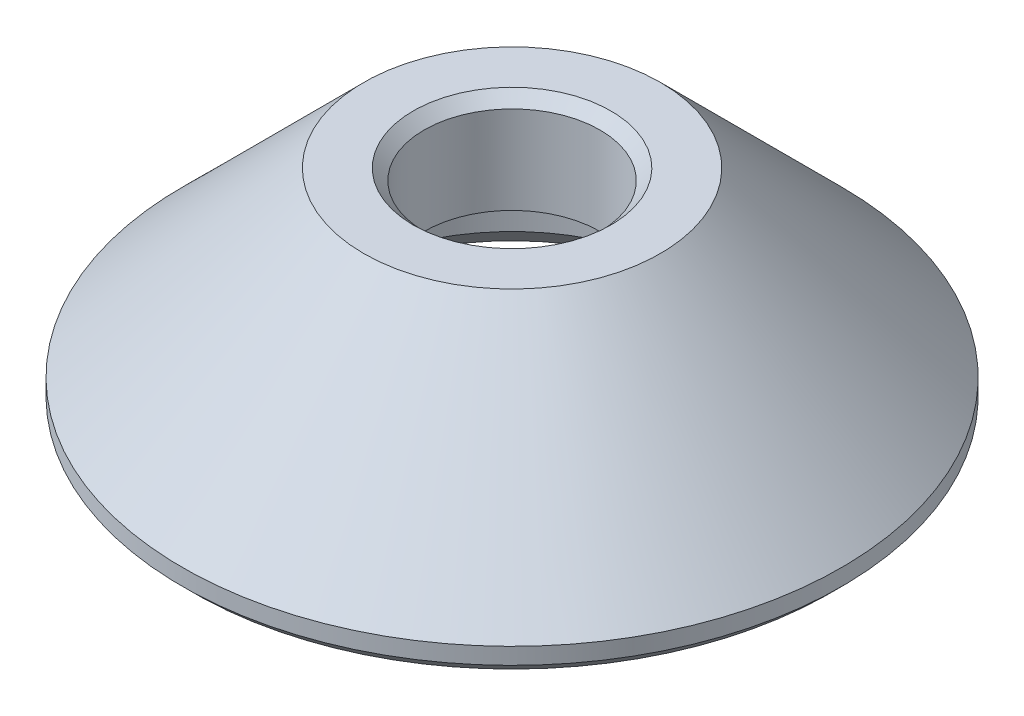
ISO-10303-21;
HEADER;
FILE_DESCRIPTION(('STEP AP214'),'2;1');
FILE_NAME('part.step','',(''),(''),'','','');
FILE_SCHEMA(('AUTOMOTIVE_DESIGN { 1 0 10303 214 1 1 1 1 }'));
ENDSEC;
DATA;
#1=APPLICATION_CONTEXT('core data for automotive mechanical design processes');
#2=APPLICATION_PROTOCOL_DEFINITION('international standard','automotive_design',2000,#1);
#3=PRODUCT_CONTEXT('',#1,'mechanical');
#4=PRODUCT('Part','Part','',(#3));
#5=PRODUCT_RELATED_PRODUCT_CATEGORY('part','',(#4));
#6=PRODUCT_DEFINITION_FORMATION('','',#4);
#7=PRODUCT_DEFINITION_CONTEXT('part definition',#1,'design');
#8=PRODUCT_DEFINITION('design','',#6,#7);
#9=PRODUCT_DEFINITION_SHAPE('','',#8);
#10=(LENGTH_UNIT() NAMED_UNIT(*) SI_UNIT(.MILLI.,.METRE.));
#11=(NAMED_UNIT(*) PLANE_ANGLE_UNIT() SI_UNIT($,.RADIAN.));
#12=(NAMED_UNIT(*) SI_UNIT($,.STERADIAN.) SOLID_ANGLE_UNIT());
#13=UNCERTAINTY_MEASURE_WITH_UNIT(LENGTH_MEASURE(1.E-05),#10,'distance_accuracy_value','');
#14=(GEOMETRIC_REPRESENTATION_CONTEXT(3) GLOBAL_UNCERTAINTY_ASSIGNED_CONTEXT((#13)) GLOBAL_UNIT_ASSIGNED_CONTEXT((#10,
#11,#12)) REPRESENTATION_CONTEXT('',''));
#15=CARTESIAN_POINT('',(0.,0.,0.));
#16=DIRECTION('',(0.,0.,1.));
#17=DIRECTION('',(1.,0.,0.));
#18=AXIS2_PLACEMENT_3D('',#15,#16,#17);
#19=CARTESIAN_POINT('',(0.,0.,0.));
#20=DIRECTION('',(0.,-1.,0.));
#21=DIRECTION('',(0.,0.,-1.));
#22=AXIS2_PLACEMENT_3D('',#19,#20,#21);
#23=CYLINDRICAL_SURFACE('',#22,3.25);
#24=CARTESIAN_POINT('',(0.,0.254773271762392,0.));
#25=DIRECTION('',(0.,-1.,0.));
#26=DIRECTION('',(0.,0.,-1.));
#27=AXIS2_PLACEMENT_3D('',#24,#25,#26);
#28=CIRCLE('',#27,3.25);
#29=CARTESIAN_POINT('',(0.,0.254773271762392,-3.25));
#30=VERTEX_POINT('',#29);
#31=EDGE_CURVE('E52',#30,#30,#28,.T.);
#32=ORIENTED_EDGE('',*,*,#31,.T.);
#33=EDGE_LOOP('',(#32));
#34=FACE_BOUND('',#33,.T.);
#35=CARTESIAN_POINT('',(0.,1.75477327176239,0.));
#36=DIRECTION('',(0.,-1.,0.));
#37=DIRECTION('',(0.,0.,-1.));
#38=AXIS2_PLACEMENT_3D('',#35,#36,#37);
#39=CIRCLE('',#38,3.25);
#40=CARTESIAN_POINT('',(0.,1.75477327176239,-3.25));
#41=VERTEX_POINT('',#40);
#42=EDGE_CURVE('E64',#41,#41,#39,.T.);
#43=ORIENTED_EDGE('',*,*,#42,.F.);
#44=EDGE_LOOP('',(#43));
#45=FACE_BOUND('',#44,.T.);
#46=ADVANCED_FACE('F29',(#34,#45),#23,.F.);
#47=CARTESIAN_POINT('',(3.25,-0.245226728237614,0.));
#48=DIRECTION('',(0.,-1.,0.));
#49=DIRECTION('',(0.,0.,-1.));
#50=AXIS2_PLACEMENT_3D('',#47,#48,#49);
#51=PLANE('',#50);
#52=CARTESIAN_POINT('',(0.,-0.245226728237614,0.));
#53=DIRECTION('',(0.,-1.,0.));
#54=DIRECTION('',(0.,0.,-1.));
#55=AXIS2_PLACEMENT_3D('',#52,#53,#54);
#56=CIRCLE('',#55,5.8);
#57=CARTESIAN_POINT('',(0.,-0.245226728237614,-5.8));
#58=VERTEX_POINT('',#57);
#59=EDGE_CURVE('E44',#58,#58,#56,.T.);
#60=ORIENTED_EDGE('',*,*,#59,.T.);
#61=EDGE_LOOP('',(#60));
#62=FACE_BOUND('',#61,.T.);
#63=CARTESIAN_POINT('',(0.,-0.245226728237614,0.));
#64=DIRECTION('',(0.,-1.,0.));
#65=DIRECTION('',(0.,0.,-1.));
#66=AXIS2_PLACEMENT_3D('',#63,#64,#65);
#67=CIRCLE('',#66,3.75000000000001);
#68=CARTESIAN_POINT('',(0.,-0.245226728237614,-3.75000000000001));
#69=VERTEX_POINT('',#68);
#70=EDGE_CURVE('E49',#69,#69,#67,.F.);
#71=ORIENTED_EDGE('',*,*,#70,.T.);
#72=EDGE_LOOP('',(#71));
#73=FACE_BOUND('',#72,.T.);
#74=ADVANCED_FACE('F72',(#62,#73),#51,.T.);
#75=CARTESIAN_POINT('',(0.,0.,0.));
#76=DIRECTION('',(0.,-1.,0.));
#77=DIRECTION('',(0.,0.,-1.));
#78=AXIS2_PLACEMENT_3D('',#75,#76,#77);
#79=CYLINDRICAL_SURFACE('',#78,6.);
#80=CARTESIAN_POINT('',(0.,-0.0452267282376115,0.));
#81=DIRECTION('',(0.,-1.,0.));
#82=DIRECTION('',(0.,0.,-1.));
#83=AXIS2_PLACEMENT_3D('',#80,#81,#82);
#84=CIRCLE('',#83,6.);
#85=CARTESIAN_POINT('',(0.,-0.0452267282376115,-6.));
#86=VERTEX_POINT('',#85);
#87=EDGE_CURVE('E40',#86,#86,#84,.F.);
#88=ORIENTED_EDGE('',*,*,#87,.T.);
#89=EDGE_LOOP('',(#88));
#90=FACE_BOUND('',#89,.T.);
#91=CARTESIAN_POINT('',(0.,0.254773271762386,0.));
#92=DIRECTION('',(0.,-1.,0.));
#93=DIRECTION('',(0.,0.,-1.));
#94=AXIS2_PLACEMENT_3D('',#91,#92,#93);
#95=CIRCLE('',#94,6.);
#96=CARTESIAN_POINT('',(0.,0.254773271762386,-6.));
#97=VERTEX_POINT('',#96);
#98=EDGE_CURVE('E55',#97,#97,#95,.T.);
#99=ORIENTED_EDGE('',*,*,#98,.T.);
#100=EDGE_LOOP('',(#99));
#101=FACE_BOUND('',#100,.T.);
#102=ADVANCED_FACE('F78',(#90,#101),#79,.T.);
#103=CARTESIAN_POINT('',(0.,0.254773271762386,0.));
#104=DIRECTION('',(0.,-1.,0.));
#105=DIRECTION('',(0.,0.,-1.));
#106=AXIS2_PLACEMENT_3D('',#103,#104,#105);
#107=CONICAL_SURFACE('',#106,6.,0.785398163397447);
#108=CARTESIAN_POINT('',(0.,3.55477327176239,0.));
#109=DIRECTION('',(0.,-1.,0.));
#110=DIRECTION('',(0.,0.,-1.));
#111=AXIS2_PLACEMENT_3D('',#108,#109,#110);
#112=CIRCLE('',#111,2.70000000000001);
#113=CARTESIAN_POINT('',(0.,3.55477327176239,-2.70000000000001));
#114=VERTEX_POINT('',#113);
#115=EDGE_CURVE('E58',#114,#114,#112,.T.);
#116=ORIENTED_EDGE('',*,*,#115,.T.);
#117=EDGE_LOOP('',(#116));
#118=FACE_BOUND('',#117,.T.);
#119=ORIENTED_EDGE('',*,*,#98,.F.);
#120=EDGE_LOOP('',(#119));
#121=FACE_BOUND('',#120,.T.);
#122=ADVANCED_FACE('F103',(#118,#121),#107,.T.);
#123=CARTESIAN_POINT('',(1.6,3.55477327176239,0.));
#124=DIRECTION('',(0.,1.,0.));
#125=DIRECTION('',(0.,0.,1.));
#126=AXIS2_PLACEMENT_3D('',#123,#124,#125);
#127=PLANE('',#126);
#128=CARTESIAN_POINT('',(0.,3.55477327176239,0.));
#129=DIRECTION('',(0.,1.,0.));
#130=DIRECTION('',(0.,0.,1.));
#131=AXIS2_PLACEMENT_3D('',#128,#129,#130);
#132=CIRCLE('',#131,1.8);
#133=CARTESIAN_POINT('',(0.,3.55477327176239,1.8));
#134=VERTEX_POINT('',#133);
#135=EDGE_CURVE('E36',#134,#134,#132,.F.);
#136=ORIENTED_EDGE('',*,*,#135,.T.);
#137=EDGE_LOOP('',(#136));
#138=FACE_BOUND('',#137,.T.);
#139=ORIENTED_EDGE('',*,*,#115,.F.);
#140=EDGE_LOOP('',(#139));
#141=FACE_BOUND('',#140,.T.);
#142=ADVANCED_FACE('F107',(#138,#141),#127,.T.);
#143=CARTESIAN_POINT('',(0.,0.,0.));
#144=DIRECTION('',(0.,-1.,0.));
#145=DIRECTION('',(0.,0.,-1.));
#146=AXIS2_PLACEMENT_3D('',#143,#144,#145);
#147=CYLINDRICAL_SURFACE('',#146,1.6);
#148=CARTESIAN_POINT('',(0.,3.35477327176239,0.));
#149=DIRECTION('',(0.,1.,0.));
#150=DIRECTION('',(0.,0.,1.));
#151=AXIS2_PLACEMENT_3D('',#148,#149,#150);
#152=CIRCLE('',#151,1.6);
#153=CARTESIAN_POINT('',(0.,3.35477327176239,1.6));
#154=VERTEX_POINT('',#153);
#155=EDGE_CURVE('E10',#154,#154,#152,.T.);
#156=ORIENTED_EDGE('',*,*,#155,.T.);
#157=EDGE_LOOP('',(#156));
#158=FACE_BOUND('',#157,.T.);
#159=CARTESIAN_POINT('',(0.,1.75477327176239,0.));
#160=DIRECTION('',(0.,-1.,0.));
#161=DIRECTION('',(0.,0.,-1.));
#162=AXIS2_PLACEMENT_3D('',#159,#160,#161);
#163=CIRCLE('',#162,1.6);
#164=CARTESIAN_POINT('',(0.,1.75477327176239,-1.6));
#165=VERTEX_POINT('',#164);
#166=EDGE_CURVE('E61',#165,#165,#163,.T.);
#167=ORIENTED_EDGE('',*,*,#166,.T.);
#168=EDGE_LOOP('',(#167));
#169=FACE_BOUND('',#168,.T.);
#170=ADVANCED_FACE('F113',(#158,#169),#147,.F.);
#171=CARTESIAN_POINT('',(1.6,1.75477327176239,0.));
#172=DIRECTION('',(0.,-1.,0.));
#173=DIRECTION('',(0.,0.,-1.));
#174=AXIS2_PLACEMENT_3D('',#171,#172,#173);
#175=PLANE('',#174);
#176=ORIENTED_EDGE('',*,*,#42,.T.);
#177=EDGE_LOOP('',(#176));
#178=FACE_BOUND('',#177,.T.);
#179=ORIENTED_EDGE('',*,*,#166,.F.);
#180=EDGE_LOOP('',(#179));
#181=FACE_BOUND('',#180,.T.);
#182=ADVANCED_FACE('F68',(#178,#181),#175,.T.);
#183=CARTESIAN_POINT('',(0.,0.254773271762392,0.));
#184=DIRECTION('',(0.,-1.,0.));
#185=DIRECTION('',(0.,0.,-1.));
#186=AXIS2_PLACEMENT_3D('',#183,#184,#185);
#187=CONICAL_SURFACE('',#186,3.25,0.785398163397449);
#188=ORIENTED_EDGE('',*,*,#70,.F.);
#189=EDGE_LOOP('',(#188));
#190=FACE_BOUND('',#189,.T.);
#191=ORIENTED_EDGE('',*,*,#31,.F.);
#192=EDGE_LOOP('',(#191));
#193=FACE_BOUND('',#192,.T.);
#194=ADVANCED_FACE('F83',(#190,#193),#187,.F.);
#195=CARTESIAN_POINT('',(0.,-0.245226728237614,0.));
#196=DIRECTION('',(0.,1.,0.));
#197=DIRECTION('',(0.,0.,1.));
#198=AXIS2_PLACEMENT_3D('',#195,#196,#197);
#199=CONICAL_SURFACE('',#198,5.8,0.785398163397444);
#200=ORIENTED_EDGE('',*,*,#87,.F.);
#201=EDGE_LOOP('',(#200));
#202=FACE_BOUND('',#201,.T.);
#203=ORIENTED_EDGE('',*,*,#59,.F.);
#204=EDGE_LOOP('',(#203));
#205=FACE_BOUND('',#204,.T.);
#206=ADVANCED_FACE('F85',(#202,#205),#199,.T.);
#207=CARTESIAN_POINT('',(0.,3.55477327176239,0.));
#208=DIRECTION('',(0.,1.,0.));
#209=DIRECTION('',(0.,0.,1.));
#210=AXIS2_PLACEMENT_3D('',#207,#208,#209);
#211=CONICAL_SURFACE('',#210,1.8,0.785398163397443);
#212=CARTESIAN_POINT('',(0.,3.35477327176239,1.6));
#213=CARTESIAN_POINT('',(0.,3.35685660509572,1.60208333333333));
#214=CARTESIAN_POINT('',(0.,3.35893993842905,1.60416666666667));
#215=CARTESIAN_POINT('',(0.,3.36310660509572,1.60833333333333));
#216=CARTESIAN_POINT('',(0.,3.36518993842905,1.61041666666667));
#217=CARTESIAN_POINT('',(0.,3.36935660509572,1.61458333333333));
#218=CARTESIAN_POINT('',(0.,3.37143993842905,1.61666666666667));
#219=CARTESIAN_POINT('',(0.,3.37560660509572,1.62083333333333));
#220=CARTESIAN_POINT('',(0.,3.37768993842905,1.62291666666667));
#221=CARTESIAN_POINT('',(0.,3.38185660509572,1.62708333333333));
#222=CARTESIAN_POINT('',(0.,3.38393993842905,1.62916666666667));
#223=CARTESIAN_POINT('',(0.,3.38810660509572,1.63333333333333));
#224=CARTESIAN_POINT('',(0.,3.39018993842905,1.63541666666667));
#225=CARTESIAN_POINT('',(0.,3.39435660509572,1.63958333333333));
#226=CARTESIAN_POINT('',(0.,3.39643993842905,1.64166666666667));
#227=CARTESIAN_POINT('',(0.,3.40060660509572,1.64583333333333));
#228=CARTESIAN_POINT('',(0.,3.40268993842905,1.64791666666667));
#229=CARTESIAN_POINT('',(0.,3.40685660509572,1.65208333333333));
#230=CARTESIAN_POINT('',(0.,3.40893993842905,1.65416666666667));
#231=CARTESIAN_POINT('',(0.,3.41310660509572,1.65833333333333));
#232=CARTESIAN_POINT('',(0.,3.41518993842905,1.66041666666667));
#233=CARTESIAN_POINT('',(0.,3.41935660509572,1.66458333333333));
#234=CARTESIAN_POINT('',(0.,3.42143993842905,1.66666666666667));
#235=CARTESIAN_POINT('',(0.,3.42560660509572,1.67083333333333));
#236=CARTESIAN_POINT('',(0.,3.42768993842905,1.67291666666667));
#237=CARTESIAN_POINT('',(0.,3.43185660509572,1.67708333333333));
#238=CARTESIAN_POINT('',(0.,3.43393993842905,1.67916666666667));
#239=CARTESIAN_POINT('',(0.,3.43810660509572,1.68333333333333));
#240=CARTESIAN_POINT('',(0.,3.44018993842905,1.68541666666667));
#241=CARTESIAN_POINT('',(0.,3.44435660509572,1.68958333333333));
#242=CARTESIAN_POINT('',(0.,3.44643993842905,1.69166666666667));
#243=CARTESIAN_POINT('',(0.,3.45060660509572,1.69583333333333));
#244=CARTESIAN_POINT('',(0.,3.45268993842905,1.69791666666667));
#245=CARTESIAN_POINT('',(0.,3.45685660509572,1.70208333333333));
#246=CARTESIAN_POINT('',(0.,3.45893993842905,1.70416666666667));
#247=CARTESIAN_POINT('',(0.,3.46310660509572,1.70833333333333));
#248=CARTESIAN_POINT('',(0.,3.46518993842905,1.71041666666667));
#249=CARTESIAN_POINT('',(0.,3.46935660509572,1.71458333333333));
#250=CARTESIAN_POINT('',(0.,3.47143993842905,1.71666666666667));
#251=CARTESIAN_POINT('',(0.,3.47560660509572,1.72083333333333));
#252=CARTESIAN_POINT('',(0.,3.47768993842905,1.72291666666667));
#253=CARTESIAN_POINT('',(0.,3.48185660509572,1.72708333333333));
#254=CARTESIAN_POINT('',(0.,3.48393993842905,1.72916666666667));
#255=CARTESIAN_POINT('',(0.,3.48810660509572,1.73333333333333));
#256=CARTESIAN_POINT('',(0.,3.49018993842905,1.73541666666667));
#257=CARTESIAN_POINT('',(0.,3.49435660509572,1.73958333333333));
#258=CARTESIAN_POINT('',(0.,3.49643993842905,1.74166666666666));
#259=CARTESIAN_POINT('',(0.,3.50060660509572,1.74583333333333));
#260=CARTESIAN_POINT('',(0.,3.50268993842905,1.74791666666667));
#261=CARTESIAN_POINT('',(0.,3.50685660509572,1.75208333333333));
#262=CARTESIAN_POINT('',(0.,3.50893993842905,1.75416666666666));
#263=CARTESIAN_POINT('',(0.,3.51310660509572,1.75833333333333));
#264=CARTESIAN_POINT('',(0.,3.51518993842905,1.76041666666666));
#265=CARTESIAN_POINT('',(0.,3.51935660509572,1.76458333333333));
#266=CARTESIAN_POINT('',(0.,3.52143993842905,1.76666666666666));
#267=CARTESIAN_POINT('',(0.,3.52560660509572,1.77083333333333));
#268=CARTESIAN_POINT('',(0.,3.52768993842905,1.77291666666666));
#269=CARTESIAN_POINT('',(0.,3.53185660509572,1.77708333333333));
#270=CARTESIAN_POINT('',(0.,3.53393993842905,1.77916666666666));
#271=CARTESIAN_POINT('',(0.,3.53810660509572,1.78333333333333));
#272=CARTESIAN_POINT('',(0.,3.54018993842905,1.78541666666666));
#273=CARTESIAN_POINT('',(0.,3.54435660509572,1.78958333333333));
#274=CARTESIAN_POINT('',(0.,3.54643993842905,1.79166666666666));
#275=CARTESIAN_POINT('',(0.,3.55060660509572,1.79583333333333));
#276=CARTESIAN_POINT('',(0.,3.55268993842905,1.79791666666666));
#277=CARTESIAN_POINT('',(0.,3.55477327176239,1.8));
#278=B_SPLINE_CURVE_WITH_KNOTS('',3,(#212,#213,#214,#215,#216,#217,#218,#219,#220,#221,#222,
#223,#224,#225,#226,#227,#228,#229,#230,#231,#232,#233,#234,#235,#236,#237,#238,#239,#240,#241,
#242,#243,#244,#245,#246,#247,#248,#249,#250,#251,#252,#253,#254,#255,#256,#257,#258,#259,#260,
#261,#262,#263,#264,#265,#266,#267,#268,#269,#270,#271,#272,#273,#274,#275,#276,#277),
.UNSPECIFIED.,.F.,.F.,(4,2,2,2,2,2,2,2,2,2,2,2,2,2,2,2,2,2,2,2,2,2,2,2,2,2,2,2,2,2,2,2,4),(0.,
0.00883883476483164,0.0176776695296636,0.0265165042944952,0.035355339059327,0.0441941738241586,
0.0530330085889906,0.0618718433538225,0.0707106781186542,0.079549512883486,0.0883883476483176,
0.0972271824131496,0.106066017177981,0.114904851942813,0.123743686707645,0.132582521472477,
0.141421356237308,0.15026019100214,0.159099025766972,0.167937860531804,0.176776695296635,
0.185615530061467,0.194454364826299,0.203293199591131,0.212132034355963,0.220970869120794,
0.229809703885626,0.238648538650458,0.24748737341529,0.256326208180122,0.265165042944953,
0.274003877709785,0.282842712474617),.UNSPECIFIED.);
#279=EDGE_CURVE('BSEAM31',#154,#134,#278,.T.);
#280=ORIENTED_EDGE('',*,*,#155,.F.);
#281=ORIENTED_EDGE('',*,*,#135,.F.);
#282=ORIENTED_EDGE('',*,*,#279,.T.);
#283=ORIENTED_EDGE('',*,*,#279,.F.);
#284=EDGE_LOOP('',(#280,#282,#281,#283));
#285=FACE_BOUND('',#284,.T.);
#286=ADVANCED_FACE('F31',(#285),#211,.F.);
#287=CLOSED_SHELL('',(#46,#74,#102,#122,#142,#170,#182,#194,#206,#286));
#288=MANIFOLD_SOLID_BREP('B2',#287);
#289=ADVANCED_BREP_SHAPE_REPRESENTATION('',(#18,#288),#14);
#290=SHAPE_DEFINITION_REPRESENTATION(#9,#289);
ENDSEC;
END-ISO-10303-21;
